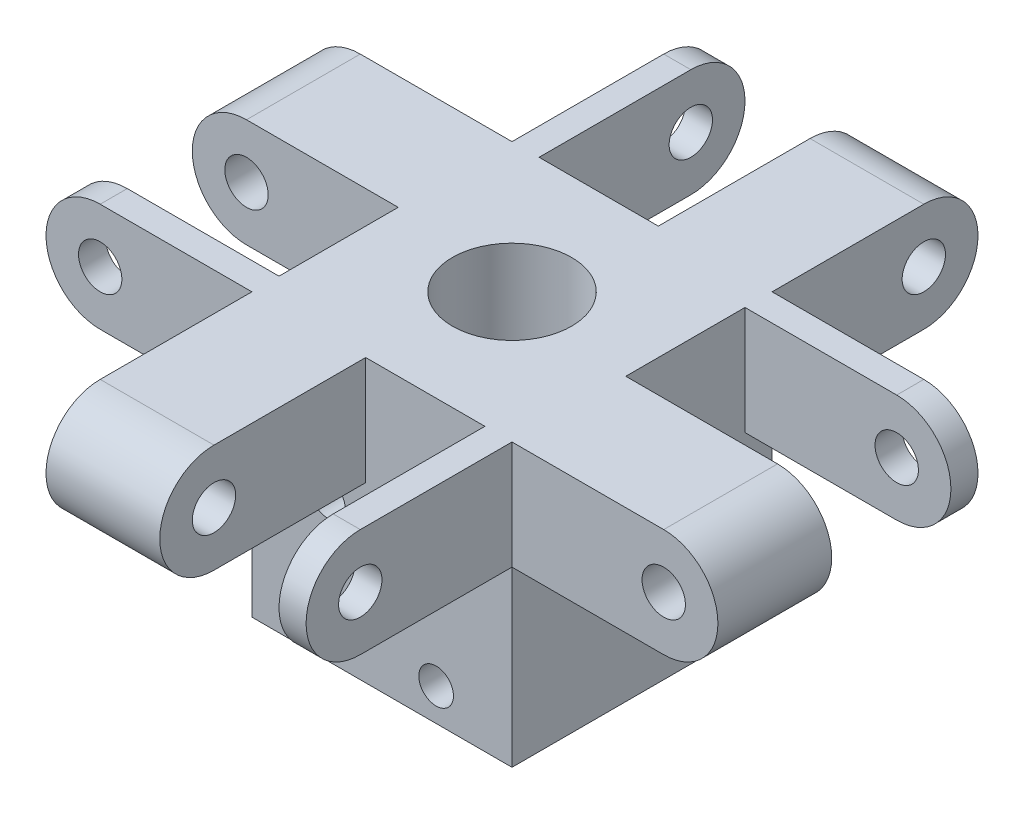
from build123d import *

# Parameters (mm, degrees)
SKETCH_1_W               = 24
SKETCH_1_H               = 24
SKETCH_1_W_2             = 18
SKETCH_1_H_2             = 18
EXTRUDE_1_DEPTH          = 26
HOLE_WIZARD_3_2_3_2_1_D  = 3.2
SKETCH_5_R               = 2
EXTRUDE_2_DEPTH          = 24
PATTERN_CIRCULAR_1_COUNT = 4
SKETCH_8_W               = 11
SKETCH_8_H               = 19
CUT_EXTRUDE_2_DEPTH      = 22
PATTERN_CIRCULAR_2_COUNT = 4
SKETCH_9_W               = 18
SKETCH_9_H               = 18
SKETCH_9_R               = 5.5
EXTRUDE_3_DEPTH          = 9


with BuildPart() as part:
    # Sketch 1 → Extrude 1 (new body)
    with BuildSketch(Plane(origin=(0, 0, 0), x_dir=(1, 0, 0), z_dir=(0, 1, 0))):
        Rectangle(SKETCH_1_W, SKETCH_1_H)
        Rectangle(SKETCH_1_W_2, SKETCH_1_H_2, mode=Mode.SUBTRACT)
    extrude(amount=EXTRUDE_1_DEPTH)

    # Hole Wizard 3.2 _3.2_ _1 (through all)
    with Locations(Plane.XY.offset(12)):
        with Locations((-5, 3), (-5, 13), (5, 13), (5, 3)):
            Hole(HOLE_WIZARD_3_2_3_2_1_D / 2)

    # Sketch 5 → Extrude 2 (add)
    with BuildSketch(Plane.ZY.offset(12)):
        with BuildLine():
            Line((12, 26), (26, 26))
            ThreePointArc((26, 26), (31, 21), (26, 16))
            Line((26, 16), (12, 16))
            Line((12, 16), (12, 26))
        make_face()
        with Locations((26, 21)):
            Circle(SKETCH_5_R, mode=Mode.SUBTRACT)
    extrude_2 = extrude(amount=-EXTRUDE_2_DEPTH)

    # Pattern Circular 1: Extrude 2 ×4 about axis
    pattern_circular_1_axis = Axis((0, 0, 0), (0, 1, 0))
    for i in range(1, PATTERN_CIRCULAR_1_COUNT):
        add(extrude_2.rotate(pattern_circular_1_axis, i * 360 / PATTERN_CIRCULAR_1_COUNT))

    # Sketch 8 → Cut-Extrude 2 (cut)
    with BuildSketch(Plane(origin=(0, 26, 0), x_dir=(1, 0, 0), z_dir=(0, 1, 0))):
        with Locations((4, -21.5)):
            Rectangle(SKETCH_8_W, SKETCH_8_H)
    cut_extrude_2 = extrude(amount=-CUT_EXTRUDE_2_DEPTH, mode=Mode.SUBTRACT)

    # Pattern Circular 2: Cut-Extrude 2 ×4 about axis
    pattern_circular_2_axis = Axis((0, 0, 0), (0, 1, 0))
    for i in range(1, PATTERN_CIRCULAR_2_COUNT):
        add(cut_extrude_2.rotate(pattern_circular_2_axis, i * 360 / PATTERN_CIRCULAR_2_COUNT), mode=Mode.SUBTRACT)

    # Sketch 9 → Extrude 3 (add)
    with BuildSketch(Plane(origin=(0, 26, 0), x_dir=(1, 0, 0), z_dir=(0, 1, 0))):
        Rectangle(SKETCH_9_W, SKETCH_9_H)
        with Locations(Location((0, 0, 0), (0, 0, 270))):
            Circle(SKETCH_9_R, mode=Mode.SUBTRACT)
    extrude(amount=-EXTRUDE_3_DEPTH)


solid = part.part
